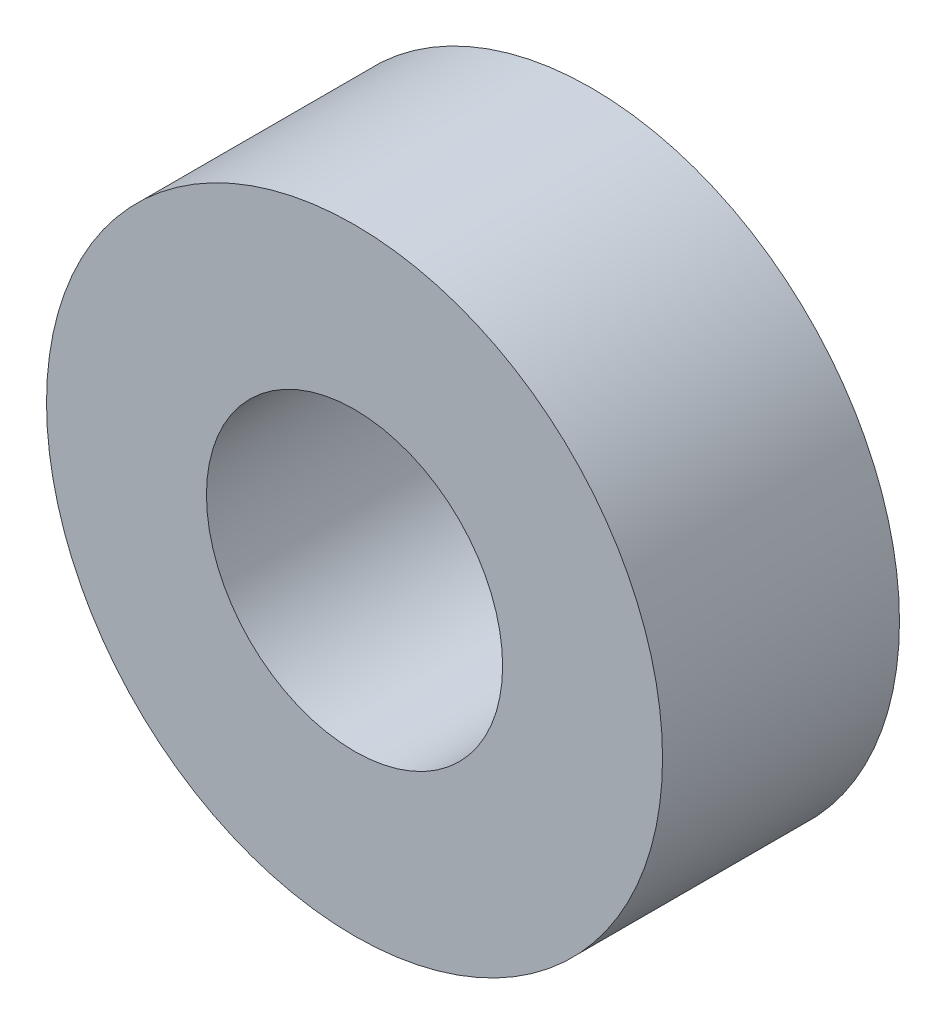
from build123d import *

# Parameters (mm, degrees)
SCHIZZO1_R        = 26
SCHIZZO1_R_2      = 12.5
ESTRUSIONE1_DEPTH = 20


with BuildPart() as part:
    # Schizzo1 → Estrusione1 (new body)
    with BuildSketch(Plane.XY):
        Circle(SCHIZZO1_R)
        Circle(SCHIZZO1_R_2, mode=Mode.SUBTRACT)
    extrude(amount=ESTRUSIONE1_DEPTH)


solid = part.part
